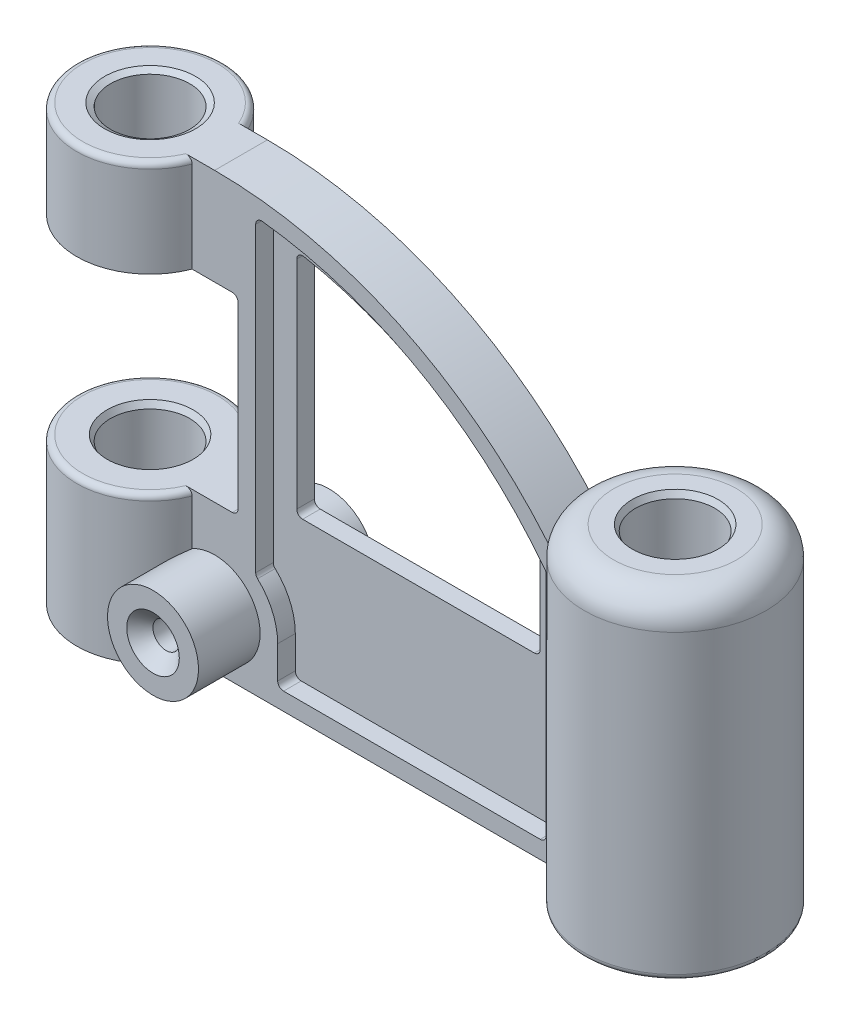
from build123d import *
from OCP.BRepFilletAPI import BRepFilletAPI_MakeChamfer

# Parameters (mm, degrees)
SKETCH1_R                                            = 13.5
BOSS_EXTRUDE1_DEPTH                                  = 148
CUT_EXTRUDE2_DEPTH                                   = 261.007692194
CUT_EXTRUDE3_DEPTH                                   = 259.775964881
CUT_EXTRUDE3_DEPTH_BACK                              = 259.775964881
SKETCH3_W                                            = 60.664793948
SKETCH3_H                                            = 100
BOSS_EXTRUDE2_REACH                                  = 242.479
SKETCH4_R                                            = 31
SKETCH4_R_2                                          = 13.5
SKETCH7_R                                            = 15.5
BOSS_EXTRUDE3_DEPTH                                  = 30
CSK_FOR_M8_HEX_SOCKET_COUNTERSUNK_CAP_SC_D           = 9
CSK_FOR_M8_HEX_SOCKET_COUNTERSUNK_CAP_SC_CSINK_D     = 17.92
CSK_FOR_M8_HEX_SOCKET_COUNTERSUNK_CAP_SC_CSINK_ANGLE = 90
CUT_EXTRUDE5_DEPTH                                   = 259.775965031
CUT_EXTRUDE5_DEPTH_BACK                              = 259.775965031
SKETCH10_W                                           = 64
SKETCH10_H                                           = 65
CUT_EXTRUDE6_DEPTH                                   = 6
CUT_EXTRUDE7_DEPTH                                   = 260.152464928
CUT_EXTRUDE7_DEPTH_BACK                              = 260.152464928
FILLET3_R                                            = 10
FILLET4_R                                            = 2
CHAMFER2_SIZE                                        = 2
CHAMFER2_SIZE2                                       = 1.154700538
FILLET5_R                                            = 2


with BuildPart() as part:
    # Sketch1 → Boss-Extrude1 (new body)
    with BuildSketch(Plane(origin=(0, 0, 0), x_dir=(1, 0, 0), z_dir=(0, 1, 0))):
        with BuildLine():
            Line((23.323807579, -9), (149.335206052, -9))
            ThreePointArc((149.335206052, -9), (210, 0), (149.335206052, 9))
            Line((149.335206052, 9), (23.323807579, 9))
            ThreePointArc((23.323807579, 9), (-25, 0), (23.323807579, -9))
        make_face()
        with Locations(Location((0, 0, 0), (0, 0, 270))):
            Circle(SKETCH1_R, mode=Mode.SUBTRACT)
        with Locations(Location((179, 0, 0), (0, 0, 270))):
            Circle(SKETCH1_R, mode=Mode.SUBTRACT)
    extrude(amount=BOSS_EXTRUDE1_DEPTH)

    # Sketch2 → Cut-Extrude2 (cut, through all)
    with BuildSketch(Plane.XY.offset(9)):
        with BuildLine():
            Line((23.323807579, 148), (31, 148))
            ThreePointArc((31, 148), (97.139336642, 132.399351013), (149.335206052, 88.886326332))
            Line((149.335206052, 88.886326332), (149.335206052, 171.443845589))
            Line((149.335206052, 171.443845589), (23.323807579, 171.443845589))
            Line((23.323807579, 171.443845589), (23.323807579, 148))
        make_face()
    extrude(amount=-CUT_EXTRUDE2_DEPTH, mode=Mode.SUBTRACT)

    # Sketch3 → Cut-Extrude3 (cut, two sides: drawn at the far end of the back side and taken through both)
    with BuildSketch(Plane.XY.offset(-CUT_EXTRUDE3_DEPTH_BACK)):
        with Locations((179.667603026, 163)):
            Rectangle(SKETCH3_W, SKETCH3_H)
    extrude(amount=CUT_EXTRUDE3_DEPTH + CUT_EXTRUDE3_DEPTH_BACK, mode=Mode.SUBTRACT)

    # Sketch4 → Boss-Extrude2 (add, up to next)
    with BuildSketch(Plane(origin=(0, 113, 0), x_dir=(1, 0, 0), z_dir=(0, 1, 0)), mode=Mode.PRIVATE) as boss_extrude2_sk1:
        with Locations(Location((179, 0, 0), (0, 0, 90))):
            Circle(SKETCH4_R)
        with Locations(Location((179, 0, 0), (0, 0, 90))):
            Circle(SKETCH4_R_2, mode=Mode.SUBTRACT)
    boss_extrude2_tool1 = extrude(boss_extrude2_sk1.sketch, amount=-BOSS_EXTRUDE2_REACH, mode=Mode.PRIVATE) - part.part
    add(boss_extrude2_tool1.solids().sort_by_distance((179, 113, 30.123188))[0])

    # Sketch7 → Boss-Extrude3 (add, symmetric)
    with BuildSketch(Plane.XY):
        with Locations(Location((31, 19, 0), (0, 0, 119.685460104))):
            Circle(SKETCH7_R)
    extrude(amount=BOSS_EXTRUDE3_DEPTH, both=True)

    # CSK for M8 Hex Socket Countersunk Cap Sc (through all)
    with Locations(Plane.XY.offset(30)):
        with Locations((31, 19)):
            CounterSinkHole(CSK_FOR_M8_HEX_SOCKET_COUNTERSUNK_CAP_SC_D / 2, CSK_FOR_M8_HEX_SOCKET_COUNTERSUNK_CAP_SC_CSINK_D / 2, counter_sink_angle=CSK_FOR_M8_HEX_SOCKET_COUNTERSUNK_CAP_SC_CSINK_ANGLE)

    # Sketch10 → Cut-Extrude5 (cut, two sides: drawn at the far end of the back side and taken through both)
    with BuildSketch(Plane.XY.offset(-CUT_EXTRUDE5_DEPTH_BACK)):
        with Locations((7, 82.5)):
            Rectangle(SKETCH10_W, SKETCH10_H)
    extrude(amount=CUT_EXTRUDE5_DEPTH + CUT_EXTRUDE5_DEPTH_BACK, mode=Mode.SUBTRACT)

    # Sketch11 → Cut-Extrude6 (cut)
    with BuildSketch(Plane.XY.offset(9)):
        with BuildLine():
            Line((144, 85.99418585), (144, 6))
            Line((144, 6), (52.5, 6))
            Line((52.5, 6), (52.5, 19))
            ThreePointArc((52.5, 19), (50.535224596, 27.979142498), (45, 35.317168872))
            Line((45, 35.317168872), (45, 141.308173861))
            ThreePointArc((45, 141.308173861), (100.261528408, 123.963061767), (144, 85.99418585))
        make_face()
    cut_extrude6 = extrude(amount=-CUT_EXTRUDE6_DEPTH, mode=Mode.SUBTRACT)

    # Mirror2: Cut-Extrude6 across plane
    add(cut_extrude6.mirror(Plane.XY), mode=Mode.SUBTRACT)

    # Sketch12 → Cut-Extrude7 (cut, two sides: drawn at the far end of the back side and taken through both)
    with BuildSketch(Plane.XY.offset(3).offset(-CUT_EXTRUDE7_DEPTH_BACK)):
        with BuildLine():
            Line((53, 54), (136, 54))
            Line((136, 54), (136, 83.252627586))
            ThreePointArc((136, 83.252627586), (99.049712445, 115.434988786), (53, 132.181693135))
            Line((53, 132.181693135), (53, 54))
        make_face()
    extrude(amount=CUT_EXTRUDE7_DEPTH + CUT_EXTRUDE7_DEPTH_BACK, mode=Mode.SUBTRACT)

    # Fillet3
    fillet3_edges = [part.edges().sort_by_distance(p)[0] for p in [
        (208.664793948, 113, 9),
    ]]
    fillet(fillet3_edges, radius=FILLET3_R)

    # Fillet4
    fillet4_edges = [part.edges().sort_by_distance(p)[0] for p in [
        (-25, 148, 0),
        (144, 6, 6),
        (52.5, 6, 6),
        (45, 35.317168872, 6),
        (45, 141.308173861, 6),
        (144, 85.99418585, 6),
        (52.5, 6, -6),
        (144, 6, -6),
        (144, 85.99418585, -6),
        (45, 141.308173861, -6),
        (45, 35.317168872, -6),
        (53, 54, 0),
        (53, 132.181693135, 0),
        (136, 83.252627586, 0),
        (136, 54, 0),
        (210, 0, 0),
        (-25, 50, 0),
    ]]
    fillet(fillet4_edges, radius=FILLET4_R)

    # Chamfer2: one chamfer whose edges measure the first distance from different faces: ONE call of the kernel's chamfer builder (chamfer() names one face for all edges)
    chamfer2_edges_1 = [part.edges().sort_by_distance(p)[0] for p in [
        (0, 0, -13.5),
        (0, 50, -13.5),
    ]]
    chamfer2_side_1 = [part.faces().sort_by_distance(p)[0] for p in [
        (0, 25, -13.5),
    ]]
    chamfer2_edges_2 = [part.edges().sort_by_distance(p)[0] for p in [
        (0, 148, -13.5),
    ]]
    chamfer2_side_2 = [part.faces().sort_by_distance(p)[0] for p in [
        (26.083005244, 148, -8.290634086),
    ]]
    chamfer2_edges_3 = [part.edges().sort_by_distance(p)[0] for p in [
        (179, 0, -13.5),
        (179, 113, -13.5),
    ]]
    chamfer2_side_3 = [part.faces().sort_by_distance(p)[0] for p in [
        (179, 56.5, -13.5),
    ]]
    chamfer2_edges_4 = [part.edges().sort_by_distance(p)[0] for p in [
        (0, 115, -13.5),
    ]]
    chamfer2_side_4 = [part.faces().sort_by_distance(p)[0] for p in [
        (0, 131.5, -13.5),
    ]]
    chamfer2 = BRepFilletAPI_MakeChamfer(part.part.solid().wrapped)
    for e in chamfer2_edges_1:
        chamfer2.Add(CHAMFER2_SIZE, CHAMFER2_SIZE2, e.wrapped, chamfer2_side_1[0].wrapped)  # the first distance lies on this face
    for e in chamfer2_edges_2:
        chamfer2.Add(CHAMFER2_SIZE, CHAMFER2_SIZE2, e.wrapped, chamfer2_side_2[0].wrapped)  # the first distance lies on this face
    for e in chamfer2_edges_3:
        chamfer2.Add(CHAMFER2_SIZE, CHAMFER2_SIZE2, e.wrapped, chamfer2_side_3[0].wrapped)  # the first distance lies on this face
    for e in chamfer2_edges_4:
        chamfer2.Add(CHAMFER2_SIZE, CHAMFER2_SIZE2, e.wrapped, chamfer2_side_4[0].wrapped)  # the first distance lies on this face
    add(Compound.cast(chamfer2.Shape()), mode=Mode.REPLACE)

    # Fillet5
    fillet5_edges = [part.edges().sort_by_distance(p)[0] for p in [
        (39, 115, 0),
        (39, 50, 0),
    ]]
    fillet(fillet5_edges, radius=FILLET5_R)


solid = part.part
